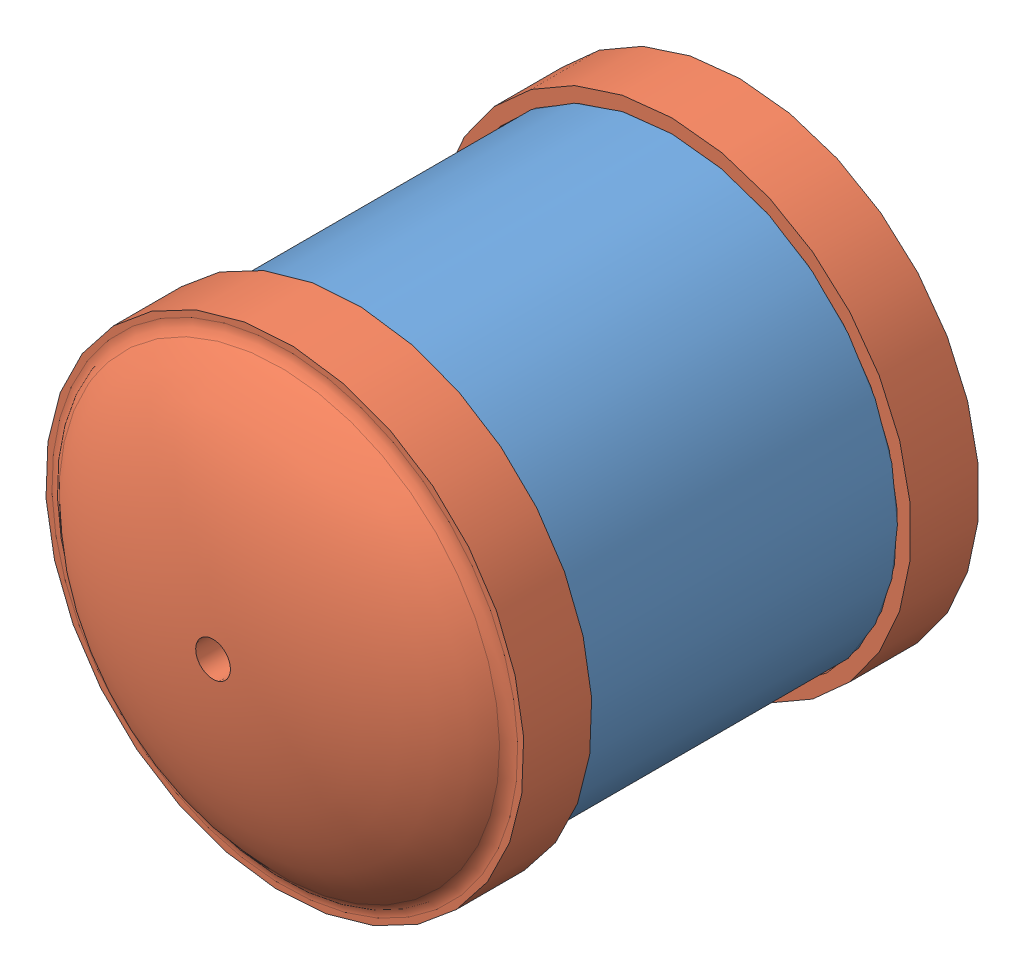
SolidWorks assembly LBV_ASSY.SLDASM, configuration Simulation_Original_Design (file format 5000). Lengths in mm.
Overall size (383.76 383.76 383.76).
15 component instances, 11 part files, 23 mates.
Components (placement in the parent):
- Support Tube-1: Support Tube.SLDPRT [COSMOS] at (0 0 -0.0506) x (1 0 0) z (0 -1 0) (suppressed, hidden)
- FLOAT4s-1: FLOAT4s.SLDPRT [Default] at origin size (377.66 139.6 220.29) (suppressed, hidden)
- View Port, Acrylic 150m-1: View Port, Acrylic 150m.SLDPRT [COSMOS] x (0 -1 0) z (1 0 0) size (165.1 151.39 165.1)
- CH End Cap - 300m STBD-no tab-revf-1: CH End Cap - 300m STBD-no tab-revf.SLDPRT [Default] at (0 0 -69.7) x (1 0 0) z (0 1 0)
- ML304-B-1: ML304-B.SLDPRT [Default] at (0 0 1.4932) size (492.52 230.34 159.47) (suppressed, hidden)
- ML303-B-1: ML303-B.SLDPRT [Default] at (0 0 -0.5068) size (493.02 232.27 167.97) (suppressed, hidden)
- Backpln1-1: Backpln1.sldprt [Default] at (125.2132 9.5 0.0317) x (0.002897 0 -0.999996) z (0 1 0) size (187 266 4.75) (suppressed, hidden)
- Aft Floatation-1: Aft Floatation.SLDPRT [Default] at (408.2835 45.8363 0) x (0 0 1) z (-0.999391 -0.034899 0) size (137 59.94 25.4) (suppressed, hidden)
- Float-Plastic Frame-3: Float-Plastic Frame.SLDPRT [Default] at (125.0206 107.95 -109.8068) size (254 25.4 25.4) (suppressed, hidden)
- Float-Plastic Frame-1: Float-Plastic Frame.SLDPRT [Default] at (125.0206 107.95 110.7932) x (-1 0 0) z (0 0 -1) size (254 25.4 25.4) (suppressed, hidden)
- Bumper Side, Plastic REVb-1: Bumper Side, Plastic REVb.SLDPRT [Default] at (17.0404 0 123.4932) x (-1 0 0) z (0 0 -1) size (539.86 254 12.7) (suppressed, hidden)
- Bumper Side, Plastic REVb-2: Bumper Side, Plastic REVb.SLDPRT [Default] at (17.0404 0 -109.8068) x (-1 0 0) z (0 0 -1) size (539.86 254 12.7) (suppressed, hidden)
- Handle, LBV-1: Handle, LBV.SLDPRT [Accessory 2] at (174.5206 127.4315 0.0499) x (1 0 -0.000832) z (0.000832 0 1) size (140.72 35.43 21.34) (suppressed, hidden)
- CH End Cap - 300m STBD-no tab-revf-4: CH End Cap - 300m STBD-no tab-revf.SLDPRT [Add Rib] at (0 0 69.6976) x (0.020072 -0.999799 0) z (-0.999799 -0.020072 0) size (175.26 52.26 175.26) (suppressed, hidden)
- CH End Cap - 300m STBD-no tab-revf-5: CH End Cap - 300m STBD-no tab-revf.SLDPRT [Default] at (0 0 69.6976) x (-0.532594 -0.846371 0) z (-0.846371 0.532594 0)
Mates (geometry in assembly coordinates):
- Coincident2: coincident aligned: plane of Bumper Side, Plastic REVb-2; plane of Bumper Side, Plastic REVb-1
- Coincident3: coincident aligned: plane of Bumper Side, Plastic REVb-2; plane of Bumper Side, Plastic REVb-1
- Coincident4: coincident anti-aligned: plane of ML303-B-1 through (-56.7749 0 110.7932) normal (0 0 1); plane of Bumper Side, Plastic REVb-1 through (17.0404 0 110.7932) normal (0 0 -1)
- Coincident5: coincident anti-aligned: plane of ML304-B-1 through (-56.7749 0 -109.8068) normal (0 0 -1); plane of Bumper Side, Plastic REVb-2 through (17.0404 0 -109.8068) normal (0 0 1)
- Coincident6: coincident aligned: plane of Bumper Side, Plastic REVb-1; plane of assembly through (0 0 0) normal (0 1 0)
- Coincident7: coincident anti-aligned: plane of Bumper Side, Plastic REVb-1 through (17.0404 0 110.7932) normal (0 0 -1); plane of Float-Plastic Frame-1 through (252.0206 120.65 110.7932) normal (0 0 1)
- Distance2: distance = 17.0404 mm anti-aligned: plane of Bumper Side, Plastic REVb-2; plane of assembly through (0 0 0) normal (1 0 0)
- Coincident11: coincident aligned: line of Bumper Side, Plastic REVb-1; line of Float-Plastic Frame-1
- Coincident31: coincident anti-aligned: plane of ML304-B-1 through (344.5 5.3 -109.8068) normal (0 0 -1); plane of Bumper Side, Plastic REVb-2 through (17.0404 0 -109.8068) normal (0 0 1)
- Parallel7: parallel: plane of assembly through (88.0273 15.75 -76.5401) normal (0 -1 0)
- Coincident60: coincident aligned: plane of FLOAT4s-1; plane of Aft Floatation-1
- Coincident61: coincident anti-aligned: plane of FLOAT4s-1 through (394.1634 17.4387 74.3247) normal (0.998021 0.034852 0.052336); plane of Aft Floatation-1 through (395.7916 -37.7086 80) normal (-0.998021 -0.034852 -0.052336)
- Coincident592: coincident aligned: plane of Float-Plastic Frame-1; plane of Float-Plastic Frame-3
- Coincident593: coincident aligned: plane of assembly through (17.0404 0 -109.8068) normal (0 0 1)
- Coincident594: coincident anti-aligned: plane of Float-Plastic Frame-1; plane of Float-Plastic Frame-3
- Coincident610: coincident anti-aligned: plane of FLOAT4s-1 through (100.7413 92 11.5087) normal (0 1 0); plane of Handle, LBV-1 through (100.9965 92 10.7791) normal (0 -1 0)
- Concentric299: concentric anti-aligned: cone of FLOAT4s-1 through (234.49 92 0) axis (0 -1 0); cylinder of Handle, LBV-1 through (234.49 122.48 0) axis (0 1 0) radius 3.3782
- Coincident6370: coincident anti-aligned: plane of ML304-B-1 through (34.176 90.1 0.4932) normal (0 0 1); plane of ML303-B-1 through (34.176 90.1 0.4932) normal (0 0 -1)
- Concentric300: concentric anti-aligned: cylinder of View Port, Acrylic 150m-1 through (0 0 -85.852) axis (0 0 -1) radius 82.55; cylinder of CH End Cap - 300m STBD-no tab-revf-4 through (0 0 156.0576) axis (0 0 1) radius 82.55
- Coincident6371: coincident anti-aligned: plane of View Port, Acrylic 150m-1 through (0 -82.55 75.692) normal (0 0 1); plane of CH End Cap - 300m STBD-no tab-revf-4 through (1.4352 -71.4856 75.692) normal (0 0 -1)
- Coincident6372: coincident aligned: plane of CH End Cap - 300m STBD-no tab-revf-1 through (36.2881 61.607 -109.6822) normal (0.895518 -0.445025 0); plane of CH End Cap - 300m STBD-no tab-revf-4 through (36.2881 61.607 109.6798) normal (0.895518 -0.445025 0)
- Concentric301: concentric anti-aligned: cylinder of View Port, Acrylic 150m-1 through (0 0 -85.852) axis (0 0 -1) radius 82.55; cylinder of CH End Cap - 300m STBD-no tab-revf-5 through (0 0 156.0576) axis (0 0 1) radius 82.55
- Coincident6373: coincident anti-aligned: plane of View Port, Acrylic 150m-1 through (0 -82.55 75.692) normal (0 0 1); plane of CH End Cap - 300m STBD-no tab-revf-5 through (-38.0805 -60.5155 75.692) normal (0 0 -1)
